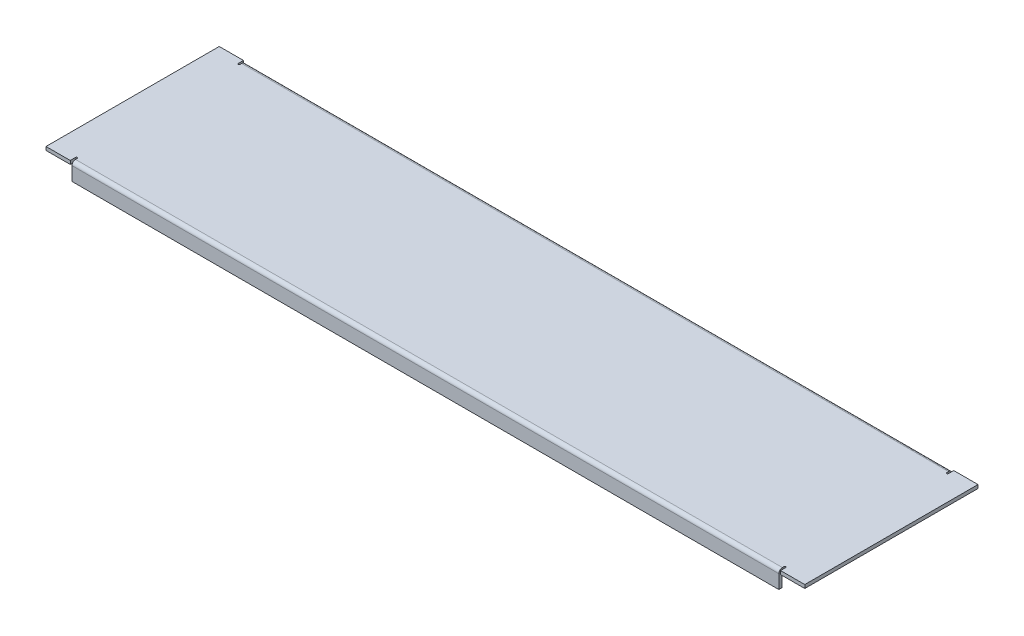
ISO-10303-21;
HEADER;
FILE_DESCRIPTION(('STEP AP214'),'2;1');
FILE_NAME('part.step','',(''),(''),'','','');
FILE_SCHEMA(('AUTOMOTIVE_DESIGN { 1 0 10303 214 1 1 1 1 }'));
ENDSEC;
DATA;
#1=APPLICATION_CONTEXT('core data for automotive mechanical design processes');
#2=APPLICATION_PROTOCOL_DEFINITION('international standard','automotive_design',2000,#1);
#3=PRODUCT_CONTEXT('',#1,'mechanical');
#4=PRODUCT('Part','Part','',(#3));
#5=PRODUCT_RELATED_PRODUCT_CATEGORY('part','',(#4));
#6=PRODUCT_DEFINITION_FORMATION('','',#4);
#7=PRODUCT_DEFINITION_CONTEXT('part definition',#1,'design');
#8=PRODUCT_DEFINITION('design','',#6,#7);
#9=PRODUCT_DEFINITION_SHAPE('','',#8);
#10=(LENGTH_UNIT() NAMED_UNIT(*) SI_UNIT(.MILLI.,.METRE.));
#11=(NAMED_UNIT(*) PLANE_ANGLE_UNIT() SI_UNIT($,.RADIAN.));
#12=(NAMED_UNIT(*) SI_UNIT($,.STERADIAN.) SOLID_ANGLE_UNIT());
#13=UNCERTAINTY_MEASURE_WITH_UNIT(LENGTH_MEASURE(1.E-05),#10,'distance_accuracy_value','');
#14=(GEOMETRIC_REPRESENTATION_CONTEXT(3) GLOBAL_UNCERTAINTY_ASSIGNED_CONTEXT((#13)) GLOBAL_UNIT_ASSIGNED_CONTEXT((#10,
#11,#12)) REPRESENTATION_CONTEXT('',''));
#15=CARTESIAN_POINT('',(0.,0.,0.));
#16=DIRECTION('',(0.,0.,1.));
#17=DIRECTION('',(1.,0.,0.));
#18=AXIS2_PLACEMENT_3D('',#15,#16,#17);
#19=CARTESIAN_POINT('',(219.,2.,-50.));
#20=DIRECTION('',(0.,-1.,0.));
#21=DIRECTION('',(0.,0.,-1.));
#22=AXIS2_PLACEMENT_3D('',#19,#20,#21);
#23=PLANE('',#22);
#24=DIRECTION('',(0.,0.,-1.));
#25=VECTOR('',#24,1.);
#26=CARTESIAN_POINT('',(205.,2.,-50.));
#27=LINE('',#26,#25);
#28=CARTESIAN_POINT('',(205.,2.,-46.95));
#29=VERTEX_POINT('',#28);
#30=CARTESIAN_POINT('',(205.,2.,-50.));
#31=VERTEX_POINT('',#30);
#32=EDGE_CURVE('E89',#29,#31,#27,.T.);
#33=ORIENTED_EDGE('',*,*,#32,.F.);
#34=CARTESIAN_POINT('',(204.5,2.,-46.95));
#35=DIRECTION('',(0.,-1.,0.));
#36=DIRECTION('',(0.,0.,-1.));
#37=AXIS2_PLACEMENT_3D('',#34,#35,#36);
#38=CIRCLE('',#37,0.5);
#39=CARTESIAN_POINT('',(204.,2.,-46.95));
#40=VERTEX_POINT('',#39);
#41=EDGE_CURVE('E93',#40,#29,#38,.F.);
#42=ORIENTED_EDGE('',*,*,#41,.F.);
#43=DIRECTION('',(0.,0.,1.));
#44=VECTOR('',#43,1.);
#45=CARTESIAN_POINT('',(204.,2.,-50.));
#46=LINE('',#45,#44);
#47=CARTESIAN_POINT('',(204.,2.00000000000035,-47.95));
#48=VERTEX_POINT('',#47);
#49=EDGE_CURVE('E373',#48,#40,#46,.T.);
#50=ORIENTED_EDGE('',*,*,#49,.F.);
#51=DIRECTION('',(1.,0.,0.));
#52=VECTOR('',#51,1.);
#53=CARTESIAN_POINT('',(204.,2.00000000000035,-47.95));
#54=LINE('',#53,#52);
#55=CARTESIAN_POINT('',(-204.,2.,-47.95));
#56=VERTEX_POINT('',#55);
#57=EDGE_CURVE('E266',#48,#56,#54,.F.);
#58=ORIENTED_EDGE('',*,*,#57,.T.);
#59=DIRECTION('',(0.,0.,-1.));
#60=VECTOR('',#59,1.);
#61=CARTESIAN_POINT('',(-204.,2.,-50.));
#62=LINE('',#61,#60);
#63=CARTESIAN_POINT('',(-204.,2.,-46.95));
#64=VERTEX_POINT('',#63);
#65=EDGE_CURVE('E370',#64,#56,#62,.T.);
#66=ORIENTED_EDGE('',*,*,#65,.F.);
#67=CARTESIAN_POINT('',(-204.5,2.,-46.95));
#68=DIRECTION('',(0.,-1.,0.));
#69=DIRECTION('',(0.,0.,-1.));
#70=AXIS2_PLACEMENT_3D('',#67,#68,#69);
#71=CIRCLE('',#70,0.5);
#72=CARTESIAN_POINT('',(-205.,2.,-46.95));
#73=VERTEX_POINT('',#72);
#74=EDGE_CURVE('E367',#73,#64,#71,.F.);
#75=ORIENTED_EDGE('',*,*,#74,.F.);
#76=DIRECTION('',(0.,0.,1.));
#77=VECTOR('',#76,1.);
#78=CARTESIAN_POINT('',(-205.,2.,-50.));
#79=LINE('',#78,#77);
#80=CARTESIAN_POINT('',(-205.,2.,-50.));
#81=VERTEX_POINT('',#80);
#82=EDGE_CURVE('E332',#81,#73,#79,.T.);
#83=ORIENTED_EDGE('',*,*,#82,.F.);
#84=DIRECTION('',(-1.,0.,0.));
#85=VECTOR('',#84,1.);
#86=CARTESIAN_POINT('',(-219.,2.,-50.));
#87=LINE('',#86,#85);
#88=CARTESIAN_POINT('',(-219.,2.,-50.));
#89=VERTEX_POINT('',#88);
#90=EDGE_CURVE('E480',#81,#89,#87,.T.);
#91=ORIENTED_EDGE('',*,*,#90,.T.);
#92=DIRECTION('',(0.,0.,1.));
#93=VECTOR('',#92,1.);
#94=CARTESIAN_POINT('',(-219.,2.,50.));
#95=LINE('',#94,#93);
#96=CARTESIAN_POINT('',(-219.,2.,50.));
#97=VERTEX_POINT('',#96);
#98=EDGE_CURVE('E484',#89,#97,#95,.T.);
#99=ORIENTED_EDGE('',*,*,#98,.T.);
#100=DIRECTION('',(1.,0.,0.));
#101=VECTOR('',#100,1.);
#102=CARTESIAN_POINT('',(-219.,2.,50.));
#103=LINE('',#102,#101);
#104=CARTESIAN_POINT('',(-205.,2.,50.));
#105=VERTEX_POINT('',#104);
#106=EDGE_CURVE('E487',#97,#105,#103,.T.);
#107=ORIENTED_EDGE('',*,*,#106,.T.);
#108=DIRECTION('',(0.,0.,1.));
#109=VECTOR('',#108,1.);
#110=CARTESIAN_POINT('',(-205.,2.,-50.));
#111=LINE('',#110,#109);
#112=CARTESIAN_POINT('',(-205.,2.,46.95));
#113=VERTEX_POINT('',#112);
#114=EDGE_CURVE('E474',#113,#105,#111,.T.);
#115=ORIENTED_EDGE('',*,*,#114,.F.);
#116=CARTESIAN_POINT('',(-204.5,2.,46.95));
#117=DIRECTION('',(0.,-1.,0.));
#118=DIRECTION('',(0.,0.,-1.));
#119=AXIS2_PLACEMENT_3D('',#116,#117,#118);
#120=CIRCLE('',#119,0.5);
#121=CARTESIAN_POINT('',(-204.,2.,46.95));
#122=VERTEX_POINT('',#121);
#123=EDGE_CURVE('E472',#122,#113,#120,.F.);
#124=ORIENTED_EDGE('',*,*,#123,.F.);
#125=DIRECTION('',(0.,0.,-1.));
#126=VECTOR('',#125,1.);
#127=CARTESIAN_POINT('',(-204.,2.,-50.));
#128=LINE('',#127,#126);
#129=CARTESIAN_POINT('',(-204.,1.99999999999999,47.95));
#130=VERTEX_POINT('',#129);
#131=EDGE_CURVE('E470',#130,#122,#128,.T.);
#132=ORIENTED_EDGE('',*,*,#131,.F.);
#133=DIRECTION('',(-1.,0.,0.));
#134=VECTOR('',#133,1.);
#135=CARTESIAN_POINT('',(-204.,1.99999999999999,47.95));
#136=LINE('',#135,#134);
#137=CARTESIAN_POINT('',(204.,2.,47.95));
#138=VERTEX_POINT('',#137);
#139=EDGE_CURVE('E409',#130,#138,#136,.F.);
#140=ORIENTED_EDGE('',*,*,#139,.T.);
#141=DIRECTION('',(0.,0.,1.));
#142=VECTOR('',#141,1.);
#143=CARTESIAN_POINT('',(204.,2.,-50.));
#144=LINE('',#143,#142);
#145=CARTESIAN_POINT('',(204.,2.,46.95));
#146=VERTEX_POINT('',#145);
#147=EDGE_CURVE('E468',#146,#138,#144,.T.);
#148=ORIENTED_EDGE('',*,*,#147,.F.);
#149=CARTESIAN_POINT('',(204.5,2.,46.95));
#150=DIRECTION('',(0.,-1.,0.));
#151=DIRECTION('',(0.,0.,-1.));
#152=AXIS2_PLACEMENT_3D('',#149,#150,#151);
#153=CIRCLE('',#152,0.5);
#154=CARTESIAN_POINT('',(205.,2.,46.95));
#155=VERTEX_POINT('',#154);
#156=EDGE_CURVE('E466',#155,#146,#153,.F.);
#157=ORIENTED_EDGE('',*,*,#156,.F.);
#158=DIRECTION('',(0.,0.,-1.));
#159=VECTOR('',#158,1.);
#160=CARTESIAN_POINT('',(205.,2.,-50.));
#161=LINE('',#160,#159);
#162=CARTESIAN_POINT('',(205.,2.,50.));
#163=VERTEX_POINT('',#162);
#164=EDGE_CURVE('E436',#163,#155,#161,.T.);
#165=ORIENTED_EDGE('',*,*,#164,.F.);
#166=CARTESIAN_POINT('',(219.,2.,50.));
#167=VERTEX_POINT('',#166);
#168=EDGE_CURVE('E486',#163,#167,#103,.T.);
#169=ORIENTED_EDGE('',*,*,#168,.T.);
#170=DIRECTION('',(0.,0.,-1.));
#171=VECTOR('',#170,1.);
#172=CARTESIAN_POINT('',(219.,2.,50.));
#173=LINE('',#172,#171);
#174=CARTESIAN_POINT('',(219.,2.,-50.));
#175=VERTEX_POINT('',#174);
#176=EDGE_CURVE('E477',#167,#175,#173,.T.);
#177=ORIENTED_EDGE('',*,*,#176,.T.);
#178=EDGE_CURVE('E482',#175,#31,#87,.T.);
#179=ORIENTED_EDGE('',*,*,#178,.T.);
#180=EDGE_LOOP('',(#33,#42,#50,#58,#66,#75,#83,#91,#99,#107,#115,#124,#132,#140,#148,#157,#165,
#169,#177,#179));
#181=FACE_BOUND('',#180,.T.);
#182=ADVANCED_FACE('F74',(#181),#23,.F.);
#183=CARTESIAN_POINT('',(219.,0.,-50.));
#184=DIRECTION('',(0.,-1.,0.));
#185=DIRECTION('',(0.,0.,-1.));
#186=AXIS2_PLACEMENT_3D('',#183,#184,#185);
#187=PLANE('',#186);
#188=CARTESIAN_POINT('',(204.5,3.53477013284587E-13,-46.95));
#189=DIRECTION('',(0.,-1.,0.));
#190=DIRECTION('',(0.,0.,-1.));
#191=AXIS2_PLACEMENT_3D('',#188,#189,#190);
#192=CIRCLE('',#191,0.5);
#193=CARTESIAN_POINT('',(205.,0.,-46.95));
#194=VERTEX_POINT('',#193);
#195=CARTESIAN_POINT('',(204.,0.,-46.95));
#196=VERTEX_POINT('',#195);
#197=EDGE_CURVE('E334',#194,#196,#192,.T.);
#198=ORIENTED_EDGE('',*,*,#197,.F.);
#199=DIRECTION('',(0.,0.,1.));
#200=VECTOR('',#199,1.);
#201=CARTESIAN_POINT('',(205.,1.76738506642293E-13,-50.));
#202=LINE('',#201,#200);
#203=CARTESIAN_POINT('',(205.,0.,-50.));
#204=VERTEX_POINT('',#203);
#205=EDGE_CURVE('E329',#204,#194,#202,.T.);
#206=ORIENTED_EDGE('',*,*,#205,.F.);
#207=DIRECTION('',(-1.,0.,0.));
#208=VECTOR('',#207,1.);
#209=CARTESIAN_POINT('',(-219.,0.,-50.));
#210=LINE('',#209,#208);
#211=CARTESIAN_POINT('',(219.,0.,-50.));
#212=VERTEX_POINT('',#211);
#213=EDGE_CURVE('E494',#212,#204,#210,.T.);
#214=ORIENTED_EDGE('',*,*,#213,.F.);
#215=DIRECTION('',(0.,0.,-1.));
#216=VECTOR('',#215,1.);
#217=CARTESIAN_POINT('',(219.,0.,50.));
#218=LINE('',#217,#216);
#219=CARTESIAN_POINT('',(219.,0.,50.));
#220=VERTEX_POINT('',#219);
#221=EDGE_CURVE('E476',#220,#212,#218,.T.);
#222=ORIENTED_EDGE('',*,*,#221,.F.);
#223=DIRECTION('',(1.,0.,0.));
#224=VECTOR('',#223,1.);
#225=CARTESIAN_POINT('',(-219.,0.,50.));
#226=LINE('',#225,#224);
#227=CARTESIAN_POINT('',(205.,0.,50.));
#228=VERTEX_POINT('',#227);
#229=EDGE_CURVE('E499',#228,#220,#226,.T.);
#230=ORIENTED_EDGE('',*,*,#229,.F.);
#231=DIRECTION('',(0.,0.,1.));
#232=VECTOR('',#231,1.);
#233=CARTESIAN_POINT('',(205.,0.,46.95));
#234=LINE('',#233,#232);
#235=CARTESIAN_POINT('',(205.,0.,46.95));
#236=VERTEX_POINT('',#235);
#237=EDGE_CURVE('E451',#236,#228,#234,.T.);
#238=ORIENTED_EDGE('',*,*,#237,.F.);
#239=CARTESIAN_POINT('',(204.5,0.,46.95));
#240=DIRECTION('',(0.,-1.,0.));
#241=DIRECTION('',(0.,0.,-1.));
#242=AXIS2_PLACEMENT_3D('',#239,#240,#241);
#243=CIRCLE('',#242,0.5);
#244=CARTESIAN_POINT('',(204.,0.,46.95));
#245=VERTEX_POINT('',#244);
#246=EDGE_CURVE('E448',#245,#236,#243,.T.);
#247=ORIENTED_EDGE('',*,*,#246,.F.);
#248=DIRECTION('',(0.,0.,-1.));
#249=VECTOR('',#248,1.);
#250=CARTESIAN_POINT('',(204.,0.,47.95));
#251=LINE('',#250,#249);
#252=CARTESIAN_POINT('',(204.,0.,47.95));
#253=VERTEX_POINT('',#252);
#254=EDGE_CURVE('E445',#253,#245,#251,.T.);
#255=ORIENTED_EDGE('',*,*,#254,.F.);
#256=DIRECTION('',(-1.,0.,0.));
#257=VECTOR('',#256,1.);
#258=CARTESIAN_POINT('',(-204.,0.,47.95));
#259=LINE('',#258,#257);
#260=CARTESIAN_POINT('',(-204.,0.,47.95));
#261=VERTEX_POINT('',#260);
#262=EDGE_CURVE('E422',#261,#253,#259,.F.);
#263=ORIENTED_EDGE('',*,*,#262,.F.);
#264=DIRECTION('',(0.,0.,1.));
#265=VECTOR('',#264,1.);
#266=CARTESIAN_POINT('',(-204.,0.,46.95));
#267=LINE('',#266,#265);
#268=CARTESIAN_POINT('',(-204.,0.,46.95));
#269=VERTEX_POINT('',#268);
#270=EDGE_CURVE('E442',#269,#261,#267,.T.);
#271=ORIENTED_EDGE('',*,*,#270,.F.);
#272=CARTESIAN_POINT('',(-204.5,0.,46.95));
#273=DIRECTION('',(0.,-1.,0.));
#274=DIRECTION('',(0.,0.,-1.));
#275=AXIS2_PLACEMENT_3D('',#272,#273,#274);
#276=CIRCLE('',#275,0.5);
#277=CARTESIAN_POINT('',(-205.,0.,46.95));
#278=VERTEX_POINT('',#277);
#279=EDGE_CURVE('E438',#278,#269,#276,.T.);
#280=ORIENTED_EDGE('',*,*,#279,.F.);
#281=DIRECTION('',(0.,0.,-1.));
#282=VECTOR('',#281,1.);
#283=CARTESIAN_POINT('',(-205.,0.,50.));
#284=LINE('',#283,#282);
#285=CARTESIAN_POINT('',(-205.,0.,50.));
#286=VERTEX_POINT('',#285);
#287=EDGE_CURVE('E433',#286,#278,#284,.T.);
#288=ORIENTED_EDGE('',*,*,#287,.F.);
#289=CARTESIAN_POINT('',(-219.,0.,50.));
#290=VERTEX_POINT('',#289);
#291=EDGE_CURVE('E481',#290,#286,#226,.T.);
#292=ORIENTED_EDGE('',*,*,#291,.F.);
#293=DIRECTION('',(0.,0.,1.));
#294=VECTOR('',#293,1.);
#295=CARTESIAN_POINT('',(-219.,0.,50.));
#296=LINE('',#295,#294);
#297=CARTESIAN_POINT('',(-219.,0.,-50.));
#298=VERTEX_POINT('',#297);
#299=EDGE_CURVE('E497',#298,#290,#296,.T.);
#300=ORIENTED_EDGE('',*,*,#299,.F.);
#301=CARTESIAN_POINT('',(-205.,0.,-50.));
#302=VERTEX_POINT('',#301);
#303=EDGE_CURVE('E493',#302,#298,#210,.T.);
#304=ORIENTED_EDGE('',*,*,#303,.F.);
#305=DIRECTION('',(0.,0.,-1.));
#306=VECTOR('',#305,1.);
#307=CARTESIAN_POINT('',(-205.,3.25829857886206E-13,-46.95));
#308=LINE('',#307,#306);
#309=CARTESIAN_POINT('',(-205.,0.,-46.95));
#310=VERTEX_POINT('',#309);
#311=EDGE_CURVE('E349',#310,#302,#308,.T.);
#312=ORIENTED_EDGE('',*,*,#311,.F.);
#313=CARTESIAN_POINT('',(-204.5,3.25829857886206E-13,-46.95));
#314=DIRECTION('',(0.,-1.,0.));
#315=DIRECTION('',(0.,0.,-1.));
#316=AXIS2_PLACEMENT_3D('',#313,#314,#315);
#317=CIRCLE('',#316,0.5);
#318=CARTESIAN_POINT('',(-204.,0.,-46.95));
#319=VERTEX_POINT('',#318);
#320=EDGE_CURVE('E345',#319,#310,#317,.T.);
#321=ORIENTED_EDGE('',*,*,#320,.F.);
#322=DIRECTION('',(0.,0.,1.));
#323=VECTOR('',#322,1.);
#324=CARTESIAN_POINT('',(-204.,3.25829857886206E-13,-47.95));
#325=LINE('',#324,#323);
#326=CARTESIAN_POINT('',(-204.,0.,-47.95));
#327=VERTEX_POINT('',#326);
#328=EDGE_CURVE('E342',#327,#319,#325,.T.);
#329=ORIENTED_EDGE('',*,*,#328,.F.);
#330=DIRECTION('',(1.,0.,0.));
#331=VECTOR('',#330,1.);
#332=CARTESIAN_POINT('',(204.,3.53477013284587E-13,-47.95));
#333=LINE('',#332,#331);
#334=CARTESIAN_POINT('',(204.,0.,-47.95));
#335=VERTEX_POINT('',#334);
#336=EDGE_CURVE('E320',#335,#327,#333,.F.);
#337=ORIENTED_EDGE('',*,*,#336,.F.);
#338=DIRECTION('',(0.,0.,-1.));
#339=VECTOR('',#338,1.);
#340=CARTESIAN_POINT('',(204.,3.53477013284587E-13,-46.95));
#341=LINE('',#340,#339);
#342=EDGE_CURVE('E338',#196,#335,#341,.T.);
#343=ORIENTED_EDGE('',*,*,#342,.F.);
#344=EDGE_LOOP('',(#198,#206,#214,#222,#230,#238,#247,#255,#263,#271,#280,#288,#292,#300,#304,
#312,#321,#329,#337,#343));
#345=FACE_BOUND('',#344,.T.);
#346=ADVANCED_FACE('F517',(#345),#187,.T.);
#347=CARTESIAN_POINT('',(-219.,2.,-50.));
#348=DIRECTION('',(0.,0.,1.));
#349=DIRECTION('',(1.,0.,0.));
#350=AXIS2_PLACEMENT_3D('',#347,#348,#349);
#351=PLANE('',#350);
#352=DIRECTION('',(0.,1.,0.));
#353=VECTOR('',#352,1.);
#354=CARTESIAN_POINT('',(205.,1.76738506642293E-13,-50.));
#355=LINE('',#354,#353);
#356=EDGE_CURVE('E333',#204,#31,#355,.T.);
#357=ORIENTED_EDGE('',*,*,#356,.T.);
#358=ORIENTED_EDGE('',*,*,#178,.F.);
#359=DIRECTION('',(0.,-1.,0.));
#360=VECTOR('',#359,1.);
#361=CARTESIAN_POINT('',(219.,2.,-50.));
#362=LINE('',#361,#360);
#363=EDGE_CURVE('E13',#175,#212,#362,.T.);
#364=ORIENTED_EDGE('',*,*,#363,.T.);
#365=ORIENTED_EDGE('',*,*,#213,.T.);
#366=EDGE_LOOP('',(#357,#358,#364,#365));
#367=FACE_BOUND('',#366,.T.);
#368=ADVANCED_FACE('F564',(#367),#351,.F.);
#369=DIRECTION('',(0.,1.,0.));
#370=VECTOR('',#369,1.);
#371=CARTESIAN_POINT('',(-205.,1.62914928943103E-13,-50.));
#372=LINE('',#371,#370);
#373=EDGE_CURVE('E352',#302,#81,#372,.T.);
#374=ORIENTED_EDGE('',*,*,#373,.F.);
#375=ORIENTED_EDGE('',*,*,#303,.T.);
#376=DIRECTION('',(0.,-1.,0.));
#377=VECTOR('',#376,1.);
#378=CARTESIAN_POINT('',(-219.,2.,-50.));
#379=LINE('',#378,#377);
#380=EDGE_CURVE('E82',#89,#298,#379,.T.);
#381=ORIENTED_EDGE('',*,*,#380,.F.);
#382=ORIENTED_EDGE('',*,*,#90,.F.);
#383=EDGE_LOOP('',(#374,#375,#381,#382));
#384=FACE_BOUND('',#383,.T.);
#385=ADVANCED_FACE('F526',(#384),#351,.F.);
#386=CARTESIAN_POINT('',(-219.,2.,50.));
#387=DIRECTION('',(0.,0.,-1.));
#388=DIRECTION('',(-1.,0.,0.));
#389=AXIS2_PLACEMENT_3D('',#386,#387,#388);
#390=PLANE('',#389);
#391=DIRECTION('',(0.,1.,0.));
#392=VECTOR('',#391,1.);
#393=CARTESIAN_POINT('',(-205.,0.,50.));
#394=LINE('',#393,#392);
#395=EDGE_CURVE('E437',#286,#105,#394,.T.);
#396=ORIENTED_EDGE('',*,*,#395,.T.);
#397=ORIENTED_EDGE('',*,*,#106,.F.);
#398=DIRECTION('',(0.,-1.,0.));
#399=VECTOR('',#398,1.);
#400=CARTESIAN_POINT('',(-219.,2.,50.));
#401=LINE('',#400,#399);
#402=EDGE_CURVE('E504',#97,#290,#401,.T.);
#403=ORIENTED_EDGE('',*,*,#402,.T.);
#404=ORIENTED_EDGE('',*,*,#291,.T.);
#405=EDGE_LOOP('',(#396,#397,#403,#404));
#406=FACE_BOUND('',#405,.T.);
#407=ADVANCED_FACE('F521',(#406),#390,.F.);
#408=DIRECTION('',(0.,1.,0.));
#409=VECTOR('',#408,1.);
#410=CARTESIAN_POINT('',(205.,0.,50.));
#411=LINE('',#410,#409);
#412=EDGE_CURVE('E453',#228,#163,#411,.T.);
#413=ORIENTED_EDGE('',*,*,#412,.F.);
#414=ORIENTED_EDGE('',*,*,#229,.T.);
#415=DIRECTION('',(0.,-1.,0.));
#416=VECTOR('',#415,1.);
#417=CARTESIAN_POINT('',(219.,2.,50.));
#418=LINE('',#417,#416);
#419=EDGE_CURVE('E490',#167,#220,#418,.T.);
#420=ORIENTED_EDGE('',*,*,#419,.F.);
#421=ORIENTED_EDGE('',*,*,#168,.F.);
#422=EDGE_LOOP('',(#413,#414,#420,#421));
#423=FACE_BOUND('',#422,.T.);
#424=ADVANCED_FACE('F572',(#423),#390,.F.);
#425=CARTESIAN_POINT('',(219.,2.,50.));
#426=DIRECTION('',(-1.,0.,0.));
#427=DIRECTION('',(0.,0.,1.));
#428=AXIS2_PLACEMENT_3D('',#425,#426,#427);
#429=PLANE('',#428);
#430=ORIENTED_EDGE('',*,*,#221,.T.);
#431=ORIENTED_EDGE('',*,*,#363,.F.);
#432=ORIENTED_EDGE('',*,*,#176,.F.);
#433=ORIENTED_EDGE('',*,*,#419,.T.);
#434=EDGE_LOOP('',(#430,#431,#432,#433));
#435=FACE_BOUND('',#434,.T.);
#436=ADVANCED_FACE('F76',(#435),#429,.F.);
#437=CARTESIAN_POINT('',(-219.,2.,50.));
#438=DIRECTION('',(1.,0.,0.));
#439=DIRECTION('',(0.,0.,-1.));
#440=AXIS2_PLACEMENT_3D('',#437,#438,#439);
#441=PLANE('',#440);
#442=ORIENTED_EDGE('',*,*,#299,.T.);
#443=ORIENTED_EDGE('',*,*,#402,.F.);
#444=ORIENTED_EDGE('',*,*,#98,.F.);
#445=ORIENTED_EDGE('',*,*,#380,.T.);
#446=EDGE_LOOP('',(#442,#443,#444,#445));
#447=FACE_BOUND('',#446,.T.);
#448=ADVANCED_FACE('F511',(#447),#441,.F.);
#449=CARTESIAN_POINT('',(-205.,0.,50.));
#450=DIRECTION('',(1.,0.,0.));
#451=DIRECTION('',(0.,0.,-1.));
#452=AXIS2_PLACEMENT_3D('',#449,#450,#451);
#453=PLANE('',#452);
#454=DIRECTION('',(0.,1.,0.));
#455=VECTOR('',#454,1.);
#456=CARTESIAN_POINT('',(-205.,0.,46.95));
#457=LINE('',#456,#455);
#458=EDGE_CURVE('E441',#278,#113,#457,.T.);
#459=ORIENTED_EDGE('',*,*,#458,.T.);
#460=ORIENTED_EDGE('',*,*,#114,.T.);
#461=ORIENTED_EDGE('',*,*,#395,.F.);
#462=ORIENTED_EDGE('',*,*,#287,.T.);
#463=EDGE_LOOP('',(#459,#460,#461,#462));
#464=FACE_BOUND('',#463,.T.);
#465=ADVANCED_FACE('F567',(#464),#453,.T.);
#466=CARTESIAN_POINT('',(-204.5,0.,46.95));
#467=DIRECTION('',(0.,1.,0.));
#468=DIRECTION('',(0.,0.,1.));
#469=AXIS2_PLACEMENT_3D('',#466,#467,#468);
#470=CYLINDRICAL_SURFACE('',#469,0.5);
#471=DIRECTION('',(0.,1.,0.));
#472=VECTOR('',#471,1.);
#473=CARTESIAN_POINT('',(-204.,0.,46.95));
#474=LINE('',#473,#472);
#475=EDGE_CURVE('E444',#269,#122,#474,.T.);
#476=ORIENTED_EDGE('',*,*,#475,.T.);
#477=ORIENTED_EDGE('',*,*,#123,.T.);
#478=ORIENTED_EDGE('',*,*,#458,.F.);
#479=ORIENTED_EDGE('',*,*,#279,.T.);
#480=EDGE_LOOP('',(#476,#477,#478,#479));
#481=FACE_BOUND('',#480,.T.);
#482=ADVANCED_FACE('F665',(#481),#470,.F.);
#483=CARTESIAN_POINT('',(-204.,0.,46.95));
#484=DIRECTION('',(-1.,0.,0.));
#485=DIRECTION('',(0.,0.,1.));
#486=AXIS2_PLACEMENT_3D('',#483,#484,#485);
#487=PLANE('',#486);
#488=DIRECTION('',(0.,1.,0.));
#489=VECTOR('',#488,1.);
#490=CARTESIAN_POINT('',(-204.,0.,47.95));
#491=LINE('',#490,#489);
#492=EDGE_CURVE('E416',#261,#130,#491,.T.);
#493=ORIENTED_EDGE('',*,*,#492,.T.);
#494=ORIENTED_EDGE('',*,*,#131,.T.);
#495=ORIENTED_EDGE('',*,*,#475,.F.);
#496=ORIENTED_EDGE('',*,*,#270,.T.);
#497=EDGE_LOOP('',(#493,#494,#495,#496));
#498=FACE_BOUND('',#497,.T.);
#499=ADVANCED_FACE('F641',(#498),#487,.T.);
#500=CARTESIAN_POINT('',(204.,0.,47.95));
#501=DIRECTION('',(1.,0.,0.));
#502=DIRECTION('',(0.,0.,-1.));
#503=AXIS2_PLACEMENT_3D('',#500,#501,#502);
#504=PLANE('',#503);
#505=DIRECTION('',(0.,1.,0.));
#506=VECTOR('',#505,1.);
#507=CARTESIAN_POINT('',(204.,0.,46.95));
#508=LINE('',#507,#506);
#509=EDGE_CURVE('E450',#245,#146,#508,.T.);
#510=ORIENTED_EDGE('',*,*,#509,.T.);
#511=ORIENTED_EDGE('',*,*,#147,.T.);
#512=DIRECTION('',(0.,1.,0.));
#513=VECTOR('',#512,1.);
#514=CARTESIAN_POINT('',(204.,0.,47.95));
#515=LINE('',#514,#513);
#516=EDGE_CURVE('E427',#253,#138,#515,.T.);
#517=ORIENTED_EDGE('',*,*,#516,.F.);
#518=ORIENTED_EDGE('',*,*,#254,.T.);
#519=EDGE_LOOP('',(#510,#511,#517,#518));
#520=FACE_BOUND('',#519,.T.);
#521=ADVANCED_FACE('F610',(#520),#504,.T.);
#522=CARTESIAN_POINT('',(204.5,0.,46.95));
#523=DIRECTION('',(0.,1.,0.));
#524=DIRECTION('',(0.,0.,1.));
#525=AXIS2_PLACEMENT_3D('',#522,#523,#524);
#526=CYLINDRICAL_SURFACE('',#525,0.5);
#527=DIRECTION('',(0.,1.,0.));
#528=VECTOR('',#527,1.);
#529=CARTESIAN_POINT('',(205.,0.,46.95));
#530=LINE('',#529,#528);
#531=EDGE_CURVE('E430',#236,#155,#530,.T.);
#532=ORIENTED_EDGE('',*,*,#531,.T.);
#533=ORIENTED_EDGE('',*,*,#156,.T.);
#534=ORIENTED_EDGE('',*,*,#509,.F.);
#535=ORIENTED_EDGE('',*,*,#246,.T.);
#536=EDGE_LOOP('',(#532,#533,#534,#535));
#537=FACE_BOUND('',#536,.T.);
#538=ADVANCED_FACE('F606',(#537),#526,.F.);
#539=CARTESIAN_POINT('',(205.,0.,46.95));
#540=DIRECTION('',(-1.,0.,0.));
#541=DIRECTION('',(0.,0.,1.));
#542=AXIS2_PLACEMENT_3D('',#539,#540,#541);
#543=PLANE('',#542);
#544=ORIENTED_EDGE('',*,*,#412,.T.);
#545=ORIENTED_EDGE('',*,*,#164,.T.);
#546=ORIENTED_EDGE('',*,*,#531,.F.);
#547=ORIENTED_EDGE('',*,*,#237,.T.);
#548=EDGE_LOOP('',(#544,#545,#546,#547));
#549=FACE_BOUND('',#548,.T.);
#550=ADVANCED_FACE('F602',(#549),#543,.T.);
#551=CARTESIAN_POINT('',(204.,-0.0500000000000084,47.95));
#552=DIRECTION('',(1.,0.,0.));
#553=DIRECTION('',(0.,0.,-1.));
#554=AXIS2_PLACEMENT_3D('',#551,#552,#553);
#555=PLANE('',#554);
#556=DIRECTION('',(0.,0.,1.));
#557=VECTOR('',#556,1.);
#558=CARTESIAN_POINT('',(204.,-0.0500000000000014,50.));
#559=LINE('',#558,#557);
#560=CARTESIAN_POINT('',(204.,-0.0500000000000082,48.));
#561=VERTEX_POINT('',#560);
#562=CARTESIAN_POINT('',(204.,-0.0500000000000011,50.));
#563=VERTEX_POINT('',#562);
#564=EDGE_CURVE('E376',#561,#563,#559,.T.);
#565=ORIENTED_EDGE('',*,*,#564,.F.);
#566=CARTESIAN_POINT('',(204.,-0.0500000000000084,47.95));
#567=DIRECTION('',(-1.,0.,0.));
#568=DIRECTION('',(0.,0.,1.));
#569=AXIS2_PLACEMENT_3D('',#566,#567,#568);
#570=CIRCLE('',#569,0.0500000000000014);
#571=EDGE_CURVE('E419',#253,#561,#570,.F.);
#572=ORIENTED_EDGE('',*,*,#571,.F.);
#573=ORIENTED_EDGE('',*,*,#516,.T.);
#574=CARTESIAN_POINT('',(204.,-0.0500000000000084,47.95));
#575=DIRECTION('',(-1.,0.,0.));
#576=DIRECTION('',(0.,0.,1.));
#577=AXIS2_PLACEMENT_3D('',#574,#575,#576);
#578=CIRCLE('',#577,2.05);
#579=EDGE_CURVE('E412',#138,#563,#578,.F.);
#580=ORIENTED_EDGE('',*,*,#579,.T.);
#581=EDGE_LOOP('',(#565,#572,#573,#580));
#582=FACE_BOUND('',#581,.T.);
#583=ADVANCED_FACE('F620',(#582),#555,.T.);
#584=CARTESIAN_POINT('',(-204.,-0.0500000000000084,47.95));
#585=DIRECTION('',(1.,0.,0.));
#586=DIRECTION('',(0.,0.,-1.));
#587=AXIS2_PLACEMENT_3D('',#584,#585,#586);
#588=PLANE('',#587);
#589=CARTESIAN_POINT('',(-204.,-0.0500000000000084,47.95));
#590=DIRECTION('',(-1.,0.,0.));
#591=DIRECTION('',(0.,0.,1.));
#592=AXIS2_PLACEMENT_3D('',#589,#590,#591);
#593=CIRCLE('',#592,0.0500000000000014);
#594=CARTESIAN_POINT('',(-204.,-0.0500000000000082,48.));
#595=VERTEX_POINT('',#594);
#596=EDGE_CURVE('E380',#595,#261,#593,.T.);
#597=ORIENTED_EDGE('',*,*,#596,.F.);
#598=DIRECTION('',(0.,0.,1.));
#599=VECTOR('',#598,1.);
#600=CARTESIAN_POINT('',(-204.,-0.0500000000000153,48.));
#601=LINE('',#600,#599);
#602=CARTESIAN_POINT('',(-204.,-0.0500000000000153,50.));
#603=VERTEX_POINT('',#602);
#604=EDGE_CURVE('E402',#595,#603,#601,.T.);
#605=ORIENTED_EDGE('',*,*,#604,.T.);
#606=CARTESIAN_POINT('',(-204.,-0.0500000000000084,47.95));
#607=DIRECTION('',(-1.,0.,0.));
#608=DIRECTION('',(0.,0.,1.));
#609=AXIS2_PLACEMENT_3D('',#606,#607,#608);
#610=CIRCLE('',#609,2.05);
#611=EDGE_CURVE('E413',#603,#130,#610,.T.);
#612=ORIENTED_EDGE('',*,*,#611,.T.);
#613=ORIENTED_EDGE('',*,*,#492,.F.);
#614=EDGE_LOOP('',(#597,#605,#612,#613));
#615=FACE_BOUND('',#614,.T.);
#616=ADVANCED_FACE('F639',(#615),#588,.F.);
#617=CARTESIAN_POINT('',(-204.,-0.0500000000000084,47.95));
#618=DIRECTION('',(-1.,0.,0.));
#619=DIRECTION('',(0.,0.,1.));
#620=AXIS2_PLACEMENT_3D('',#617,#618,#619);
#621=CYLINDRICAL_SURFACE('',#620,2.05);
#622=ORIENTED_EDGE('',*,*,#139,.F.);
#623=ORIENTED_EDGE('',*,*,#611,.F.);
#624=DIRECTION('',(-1.,0.,0.));
#625=VECTOR('',#624,1.);
#626=CARTESIAN_POINT('',(204.,-0.0500000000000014,50.));
#627=LINE('',#626,#625);
#628=EDGE_CURVE('E399',#563,#603,#627,.T.);
#629=ORIENTED_EDGE('',*,*,#628,.F.);
#630=ORIENTED_EDGE('',*,*,#579,.F.);
#631=EDGE_LOOP('',(#622,#623,#629,#630));
#632=FACE_BOUND('',#631,.T.);
#633=ADVANCED_FACE('F643',(#632),#621,.T.);
#634=CARTESIAN_POINT('',(-204.,-0.0500000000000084,47.95));
#635=DIRECTION('',(-1.,0.,0.));
#636=DIRECTION('',(0.,0.,1.));
#637=AXIS2_PLACEMENT_3D('',#634,#635,#636);
#638=CYLINDRICAL_SURFACE('',#637,0.0500000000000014);
#639=ORIENTED_EDGE('',*,*,#262,.T.);
#640=ORIENTED_EDGE('',*,*,#571,.T.);
#641=DIRECTION('',(1.,0.,0.));
#642=VECTOR('',#641,1.);
#643=CARTESIAN_POINT('',(204.,-0.0500000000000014,48.));
#644=LINE('',#643,#642);
#645=EDGE_CURVE('E405',#561,#595,#644,.F.);
#646=ORIENTED_EDGE('',*,*,#645,.T.);
#647=ORIENTED_EDGE('',*,*,#596,.T.);
#648=EDGE_LOOP('',(#639,#640,#646,#647));
#649=FACE_BOUND('',#648,.T.);
#650=ADVANCED_FACE('F616',(#649),#638,.F.);
#651=CARTESIAN_POINT('',(204.,-8.,50.));
#652=DIRECTION('',(1.,0.,0.));
#653=DIRECTION('',(0.,0.,-1.));
#654=AXIS2_PLACEMENT_3D('',#651,#652,#653);
#655=PLANE('',#654);
#656=DIRECTION('',(0.,1.,0.));
#657=VECTOR('',#656,1.);
#658=CARTESIAN_POINT('',(204.,-8.00000000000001,48.));
#659=LINE('',#658,#657);
#660=CARTESIAN_POINT('',(204.,-8.00000000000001,48.));
#661=VERTEX_POINT('',#660);
#662=EDGE_CURVE('E391',#561,#661,#659,.F.);
#663=ORIENTED_EDGE('',*,*,#662,.F.);
#664=ORIENTED_EDGE('',*,*,#564,.T.);
#665=DIRECTION('',(0.,-1.,0.));
#666=VECTOR('',#665,1.);
#667=CARTESIAN_POINT('',(204.,-8.,50.));
#668=LINE('',#667,#666);
#669=CARTESIAN_POINT('',(204.,-8.,50.));
#670=VERTEX_POINT('',#669);
#671=EDGE_CURVE('E383',#563,#670,#668,.T.);
#672=ORIENTED_EDGE('',*,*,#671,.T.);
#673=DIRECTION('',(0.,0.,-1.));
#674=VECTOR('',#673,1.);
#675=CARTESIAN_POINT('',(204.,-8.,50.));
#676=LINE('',#675,#674);
#677=EDGE_CURVE('E377',#670,#661,#676,.T.);
#678=ORIENTED_EDGE('',*,*,#677,.T.);
#679=EDGE_LOOP('',(#663,#664,#672,#678));
#680=FACE_BOUND('',#679,.T.);
#681=ADVANCED_FACE('F625',(#680),#655,.T.);
#682=CARTESIAN_POINT('',(-204.,-8.,50.));
#683=DIRECTION('',(-1.,0.,0.));
#684=DIRECTION('',(0.,0.,1.));
#685=AXIS2_PLACEMENT_3D('',#682,#683,#684);
#686=PLANE('',#685);
#687=DIRECTION('',(0.,1.,0.));
#688=VECTOR('',#687,1.);
#689=CARTESIAN_POINT('',(-204.,-8.,50.));
#690=LINE('',#689,#688);
#691=CARTESIAN_POINT('',(-204.,-8.,50.));
#692=VERTEX_POINT('',#691);
#693=EDGE_CURVE('E385',#692,#603,#690,.T.);
#694=ORIENTED_EDGE('',*,*,#693,.T.);
#695=ORIENTED_EDGE('',*,*,#604,.F.);
#696=DIRECTION('',(0.,-1.,0.));
#697=VECTOR('',#696,1.);
#698=CARTESIAN_POINT('',(-204.,-8.00000000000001,48.));
#699=LINE('',#698,#697);
#700=CARTESIAN_POINT('',(-204.,-8.00000000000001,48.));
#701=VERTEX_POINT('',#700);
#702=EDGE_CURVE('E393',#701,#595,#699,.F.);
#703=ORIENTED_EDGE('',*,*,#702,.F.);
#704=DIRECTION('',(0.,0.,-1.));
#705=VECTOR('',#704,1.);
#706=CARTESIAN_POINT('',(-204.,-8.,50.));
#707=LINE('',#706,#705);
#708=EDGE_CURVE('E381',#692,#701,#707,.T.);
#709=ORIENTED_EDGE('',*,*,#708,.F.);
#710=EDGE_LOOP('',(#694,#695,#703,#709));
#711=FACE_BOUND('',#710,.T.);
#712=ADVANCED_FACE('F885',(#711),#686,.T.);
#713=CARTESIAN_POINT('',(204.,-8.,50.));
#714=DIRECTION('',(0.,0.,1.));
#715=DIRECTION('',(0.,-1.,0.));
#716=AXIS2_PLACEMENT_3D('',#713,#714,#715);
#717=PLANE('',#716);
#718=ORIENTED_EDGE('',*,*,#671,.F.);
#719=ORIENTED_EDGE('',*,*,#628,.T.);
#720=ORIENTED_EDGE('',*,*,#693,.F.);
#721=DIRECTION('',(-1.,0.,0.));
#722=VECTOR('',#721,1.);
#723=CARTESIAN_POINT('',(-204.,-8.,50.));
#724=LINE('',#723,#722);
#725=EDGE_CURVE('E388',#670,#692,#724,.T.);
#726=ORIENTED_EDGE('',*,*,#725,.F.);
#727=EDGE_LOOP('',(#718,#719,#720,#726));
#728=FACE_BOUND('',#727,.T.);
#729=ADVANCED_FACE('F629',(#728),#717,.T.);
#730=CARTESIAN_POINT('',(204.,-8.00000000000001,48.));
#731=DIRECTION('',(0.,0.,1.));
#732=DIRECTION('',(0.,-1.,0.));
#733=AXIS2_PLACEMENT_3D('',#730,#731,#732);
#734=PLANE('',#733);
#735=ORIENTED_EDGE('',*,*,#645,.F.);
#736=ORIENTED_EDGE('',*,*,#662,.T.);
#737=DIRECTION('',(1.,0.,0.));
#738=VECTOR('',#737,1.);
#739=CARTESIAN_POINT('',(204.,-8.00000000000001,48.));
#740=LINE('',#739,#738);
#741=EDGE_CURVE('E396',#661,#701,#740,.F.);
#742=ORIENTED_EDGE('',*,*,#741,.T.);
#743=ORIENTED_EDGE('',*,*,#702,.T.);
#744=EDGE_LOOP('',(#735,#736,#742,#743));
#745=FACE_BOUND('',#744,.T.);
#746=ADVANCED_FACE('F636',(#745),#734,.F.);
#747=CARTESIAN_POINT('',(-204.,-8.,50.));
#748=DIRECTION('',(0.,-1.,0.));
#749=DIRECTION('',(0.,0.,-1.));
#750=AXIS2_PLACEMENT_3D('',#747,#748,#749);
#751=PLANE('',#750);
#752=ORIENTED_EDGE('',*,*,#741,.F.);
#753=ORIENTED_EDGE('',*,*,#677,.F.);
#754=ORIENTED_EDGE('',*,*,#725,.T.);
#755=ORIENTED_EDGE('',*,*,#708,.T.);
#756=EDGE_LOOP('',(#752,#753,#754,#755));
#757=FACE_BOUND('',#756,.T.);
#758=ADVANCED_FACE('F633',(#757),#751,.T.);
#759=CARTESIAN_POINT('',(204.5,3.53477013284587E-13,-46.95));
#760=DIRECTION('',(0.,1.,0.));
#761=DIRECTION('',(0.,0.,1.));
#762=AXIS2_PLACEMENT_3D('',#759,#760,#761);
#763=CYLINDRICAL_SURFACE('',#762,0.5);
#764=DIRECTION('',(0.,1.,0.));
#765=VECTOR('',#764,1.);
#766=CARTESIAN_POINT('',(204.,3.53477013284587E-13,-46.95));
#767=LINE('',#766,#765);
#768=EDGE_CURVE('E341',#196,#40,#767,.T.);
#769=ORIENTED_EDGE('',*,*,#768,.T.);
#770=ORIENTED_EDGE('',*,*,#41,.T.);
#771=DIRECTION('',(0.,1.,0.));
#772=VECTOR('',#771,1.);
#773=CARTESIAN_POINT('',(205.,3.53477013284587E-13,-46.95));
#774=LINE('',#773,#772);
#775=EDGE_CURVE('E337',#194,#29,#774,.T.);
#776=ORIENTED_EDGE('',*,*,#775,.F.);
#777=ORIENTED_EDGE('',*,*,#197,.T.);
#778=EDGE_LOOP('',(#769,#770,#776,#777));
#779=FACE_BOUND('',#778,.T.);
#780=ADVANCED_FACE('F586',(#779),#763,.F.);
#781=CARTESIAN_POINT('',(204.,3.53477013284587E-13,-46.95));
#782=DIRECTION('',(1.,0.,0.));
#783=DIRECTION('',(0.,0.,-1.));
#784=AXIS2_PLACEMENT_3D('',#781,#782,#783);
#785=PLANE('',#784);
#786=DIRECTION('',(0.,1.,0.));
#787=VECTOR('',#786,1.);
#788=CARTESIAN_POINT('',(204.,3.53477013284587E-13,-47.95));
#789=LINE('',#788,#787);
#790=EDGE_CURVE('E316',#335,#48,#789,.T.);
#791=ORIENTED_EDGE('',*,*,#790,.T.);
#792=ORIENTED_EDGE('',*,*,#49,.T.);
#793=ORIENTED_EDGE('',*,*,#768,.F.);
#794=ORIENTED_EDGE('',*,*,#342,.T.);
#795=EDGE_LOOP('',(#791,#792,#793,#794));
#796=FACE_BOUND('',#795,.T.);
#797=ADVANCED_FACE('F589',(#796),#785,.T.);
#798=CARTESIAN_POINT('',(-204.,3.25829857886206E-13,-47.95));
#799=DIRECTION('',(-1.,0.,0.));
#800=DIRECTION('',(0.,0.,1.));
#801=AXIS2_PLACEMENT_3D('',#798,#799,#800);
#802=PLANE('',#801);
#803=DIRECTION('',(0.,1.,0.));
#804=VECTOR('',#803,1.);
#805=CARTESIAN_POINT('',(-204.,3.25829857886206E-13,-46.95));
#806=LINE('',#805,#804);
#807=EDGE_CURVE('E348',#319,#64,#806,.T.);
#808=ORIENTED_EDGE('',*,*,#807,.T.);
#809=ORIENTED_EDGE('',*,*,#65,.T.);
#810=DIRECTION('',(0.,1.,0.));
#811=VECTOR('',#810,1.);
#812=CARTESIAN_POINT('',(-204.,3.25829857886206E-13,-47.95));
#813=LINE('',#812,#811);
#814=EDGE_CURVE('E324',#327,#56,#813,.T.);
#815=ORIENTED_EDGE('',*,*,#814,.F.);
#816=ORIENTED_EDGE('',*,*,#328,.T.);
#817=EDGE_LOOP('',(#808,#809,#815,#816));
#818=FACE_BOUND('',#817,.T.);
#819=ADVANCED_FACE('F535',(#818),#802,.T.);
#820=CARTESIAN_POINT('',(-204.5,3.25829857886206E-13,-46.95));
#821=DIRECTION('',(0.,1.,0.));
#822=DIRECTION('',(0.,0.,1.));
#823=AXIS2_PLACEMENT_3D('',#820,#821,#822);
#824=CYLINDRICAL_SURFACE('',#823,0.5);
#825=DIRECTION('',(0.,1.,0.));
#826=VECTOR('',#825,1.);
#827=CARTESIAN_POINT('',(-205.,3.25829857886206E-13,-46.95));
#828=LINE('',#827,#826);
#829=EDGE_CURVE('E327',#310,#73,#828,.T.);
#830=ORIENTED_EDGE('',*,*,#829,.T.);
#831=ORIENTED_EDGE('',*,*,#74,.T.);
#832=ORIENTED_EDGE('',*,*,#807,.F.);
#833=ORIENTED_EDGE('',*,*,#320,.T.);
#834=EDGE_LOOP('',(#830,#831,#832,#833));
#835=FACE_BOUND('',#834,.T.);
#836=ADVANCED_FACE('F533',(#835),#824,.F.);
#837=CARTESIAN_POINT('',(205.,1.76738506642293E-13,-50.));
#838=DIRECTION('',(-1.,0.,0.));
#839=DIRECTION('',(0.,0.,1.));
#840=AXIS2_PLACEMENT_3D('',#837,#838,#839);
#841=PLANE('',#840);
#842=ORIENTED_EDGE('',*,*,#775,.T.);
#843=ORIENTED_EDGE('',*,*,#32,.T.);
#844=ORIENTED_EDGE('',*,*,#356,.F.);
#845=ORIENTED_EDGE('',*,*,#205,.T.);
#846=EDGE_LOOP('',(#842,#843,#844,#845));
#847=FACE_BOUND('',#846,.T.);
#848=ADVANCED_FACE('F583',(#847),#841,.T.);
#849=CARTESIAN_POINT('',(-205.,3.25829857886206E-13,-46.95));
#850=DIRECTION('',(1.,0.,0.));
#851=DIRECTION('',(0.,0.,-1.));
#852=AXIS2_PLACEMENT_3D('',#849,#850,#851);
#853=PLANE('',#852);
#854=ORIENTED_EDGE('',*,*,#373,.T.);
#855=ORIENTED_EDGE('',*,*,#82,.T.);
#856=ORIENTED_EDGE('',*,*,#829,.F.);
#857=ORIENTED_EDGE('',*,*,#311,.T.);
#858=EDGE_LOOP('',(#854,#855,#856,#857));
#859=FACE_BOUND('',#858,.T.);
#860=ADVANCED_FACE('F528',(#859),#853,.T.);
#861=CARTESIAN_POINT('',(-204.,-0.0499999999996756,-47.95));
#862=DIRECTION('',(-1.,0.,0.));
#863=DIRECTION('',(0.,-1.,0.));
#864=AXIS2_PLACEMENT_3D('',#861,#862,#863);
#865=PLANE('',#864);
#866=DIRECTION('',(0.,0.,-1.));
#867=VECTOR('',#866,1.);
#868=CARTESIAN_POINT('',(-204.,-0.0499999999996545,-50.));
#869=LINE('',#868,#867);
#870=CARTESIAN_POINT('',(-204.,-0.0499999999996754,-48.));
#871=VERTEX_POINT('',#870);
#872=CARTESIAN_POINT('',(-204.,-0.0499999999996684,-50.));
#873=VERTEX_POINT('',#872);
#874=EDGE_CURVE('E311',#871,#873,#869,.T.);
#875=ORIENTED_EDGE('',*,*,#874,.F.);
#876=CARTESIAN_POINT('',(-204.,-0.0499999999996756,-47.95));
#877=DIRECTION('',(1.,0.,0.));
#878=DIRECTION('',(0.,1.,0.));
#879=AXIS2_PLACEMENT_3D('',#876,#877,#878);
#880=CIRCLE('',#879,0.0500000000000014);
#881=EDGE_CURVE('E269',#327,#871,#880,.F.);
#882=ORIENTED_EDGE('',*,*,#881,.F.);
#883=ORIENTED_EDGE('',*,*,#814,.T.);
#884=CARTESIAN_POINT('',(-204.,-0.0499999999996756,-47.95));
#885=DIRECTION('',(1.,0.,0.));
#886=DIRECTION('',(0.,1.,0.));
#887=AXIS2_PLACEMENT_3D('',#884,#885,#886);
#888=CIRCLE('',#887,2.05);
#889=EDGE_CURVE('E315',#56,#873,#888,.F.);
#890=ORIENTED_EDGE('',*,*,#889,.T.);
#891=EDGE_LOOP('',(#875,#882,#883,#890));
#892=FACE_BOUND('',#891,.T.);
#893=ADVANCED_FACE('F541',(#892),#865,.T.);
#894=CARTESIAN_POINT('',(204.,-0.049999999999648,-47.95));
#895=DIRECTION('',(-1.,0.,0.));
#896=DIRECTION('',(0.,-1.,0.));
#897=AXIS2_PLACEMENT_3D('',#894,#895,#896);
#898=PLANE('',#897);
#899=CARTESIAN_POINT('',(204.,-0.049999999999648,-47.95));
#900=DIRECTION('',(1.,0.,0.));
#901=DIRECTION('',(0.,1.,0.));
#902=AXIS2_PLACEMENT_3D('',#899,#900,#901);
#903=CIRCLE('',#902,0.0500000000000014);
#904=CARTESIAN_POINT('',(204.,-0.0499999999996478,-48.));
#905=VERTEX_POINT('',#904);
#906=EDGE_CURVE('E276',#905,#335,#903,.T.);
#907=ORIENTED_EDGE('',*,*,#906,.F.);
#908=DIRECTION('',(0.,0.,-1.));
#909=VECTOR('',#908,1.);
#910=CARTESIAN_POINT('',(204.,-0.0499999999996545,-48.));
#911=LINE('',#910,#909);
#912=CARTESIAN_POINT('',(204.,-0.0499999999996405,-50.));
#913=VERTEX_POINT('',#912);
#914=EDGE_CURVE('E273',#905,#913,#911,.T.);
#915=ORIENTED_EDGE('',*,*,#914,.T.);
#916=CARTESIAN_POINT('',(204.,-0.049999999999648,-47.95));
#917=DIRECTION('',(1.,0.,0.));
#918=DIRECTION('',(0.,1.,0.));
#919=AXIS2_PLACEMENT_3D('',#916,#917,#918);
#920=CIRCLE('',#919,2.05);
#921=EDGE_CURVE('E259',#913,#48,#920,.T.);
#922=ORIENTED_EDGE('',*,*,#921,.T.);
#923=ORIENTED_EDGE('',*,*,#790,.F.);
#924=EDGE_LOOP('',(#907,#915,#922,#923));
#925=FACE_BOUND('',#924,.T.);
#926=ADVANCED_FACE('F274',(#925),#898,.F.);
#927=CARTESIAN_POINT('',(204.,-0.049999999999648,-47.95));
#928=DIRECTION('',(1.,0.,0.));
#929=DIRECTION('',(0.,0.,-1.));
#930=AXIS2_PLACEMENT_3D('',#927,#928,#929);
#931=CYLINDRICAL_SURFACE('',#930,2.05);
#932=ORIENTED_EDGE('',*,*,#57,.F.);
#933=ORIENTED_EDGE('',*,*,#921,.F.);
#934=DIRECTION('',(1.,0.,0.));
#935=VECTOR('',#934,1.);
#936=CARTESIAN_POINT('',(-204.,-0.0499999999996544,-50.));
#937=LINE('',#936,#935);
#938=EDGE_CURVE('E264',#873,#913,#937,.T.);
#939=ORIENTED_EDGE('',*,*,#938,.F.);
#940=ORIENTED_EDGE('',*,*,#889,.F.);
#941=EDGE_LOOP('',(#932,#933,#939,#940));
#942=FACE_BOUND('',#941,.T.);
#943=ADVANCED_FACE('F261',(#942),#931,.T.);
#944=CARTESIAN_POINT('',(204.,-0.049999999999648,-47.95));
#945=DIRECTION('',(1.,0.,0.));
#946=DIRECTION('',(0.,0.,-1.));
#947=AXIS2_PLACEMENT_3D('',#944,#945,#946);
#948=CYLINDRICAL_SURFACE('',#947,0.0500000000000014);
#949=ORIENTED_EDGE('',*,*,#336,.T.);
#950=ORIENTED_EDGE('',*,*,#881,.T.);
#951=DIRECTION('',(-1.,0.,0.));
#952=VECTOR('',#951,1.);
#953=CARTESIAN_POINT('',(-204.,-0.0499999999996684,-48.));
#954=LINE('',#953,#952);
#955=EDGE_CURVE('E281',#871,#905,#954,.F.);
#956=ORIENTED_EDGE('',*,*,#955,.T.);
#957=ORIENTED_EDGE('',*,*,#906,.T.);
#958=EDGE_LOOP('',(#949,#950,#956,#957));
#959=FACE_BOUND('',#958,.T.);
#960=ADVANCED_FACE('F539',(#959),#948,.F.);
#961=CARTESIAN_POINT('',(-204.,-7.99999999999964,-50.));
#962=DIRECTION('',(-1.,0.,0.));
#963=DIRECTION('',(0.,0.,1.));
#964=AXIS2_PLACEMENT_3D('',#961,#962,#963);
#965=PLANE('',#964);
#966=DIRECTION('',(0.,1.,0.));
#967=VECTOR('',#966,1.);
#968=CARTESIAN_POINT('',(-204.,3.35051901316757E-13,-48.));
#969=LINE('',#968,#967);
#970=CARTESIAN_POINT('',(-204.,-7.99999999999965,-48.));
#971=VERTEX_POINT('',#970);
#972=EDGE_CURVE('E291',#871,#971,#969,.F.);
#973=ORIENTED_EDGE('',*,*,#972,.F.);
#974=ORIENTED_EDGE('',*,*,#874,.T.);
#975=DIRECTION('',(0.,-1.,0.));
#976=VECTOR('',#975,1.);
#977=CARTESIAN_POINT('',(-204.,-7.99999999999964,-50.));
#978=LINE('',#977,#976);
#979=CARTESIAN_POINT('',(-204.,-7.99999999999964,-50.));
#980=VERTEX_POINT('',#979);
#981=EDGE_CURVE('E290',#873,#980,#978,.T.);
#982=ORIENTED_EDGE('',*,*,#981,.T.);
#983=DIRECTION('',(0.,0.,1.));
#984=VECTOR('',#983,1.);
#985=CARTESIAN_POINT('',(-204.,-7.99999999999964,-50.));
#986=LINE('',#985,#984);
#987=EDGE_CURVE('E295',#980,#971,#986,.T.);
#988=ORIENTED_EDGE('',*,*,#987,.T.);
#989=EDGE_LOOP('',(#973,#974,#982,#988));
#990=FACE_BOUND('',#989,.T.);
#991=ADVANCED_FACE('F544',(#990),#965,.T.);
#992=CARTESIAN_POINT('',(204.,3.42034868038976E-13,-50.));
#993=DIRECTION('',(1.,0.,0.));
#994=DIRECTION('',(0.,0.,-1.));
#995=AXIS2_PLACEMENT_3D('',#992,#993,#994);
#996=PLANE('',#995);
#997=DIRECTION('',(0.,1.,0.));
#998=VECTOR('',#997,1.);
#999=CARTESIAN_POINT('',(204.,3.42034868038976E-13,-50.));
#1000=LINE('',#999,#998);
#1001=CARTESIAN_POINT('',(204.,-7.99999999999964,-50.));
#1002=VERTEX_POINT('',#1001);
#1003=EDGE_CURVE('E288',#1002,#913,#1000,.T.);
#1004=ORIENTED_EDGE('',*,*,#1003,.T.);
#1005=ORIENTED_EDGE('',*,*,#914,.F.);
#1006=DIRECTION('',(0.,-1.,0.));
#1007=VECTOR('',#1006,1.);
#1008=CARTESIAN_POINT('',(204.,3.35051901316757E-13,-48.));
#1009=LINE('',#1008,#1007);
#1010=CARTESIAN_POINT('',(204.,-7.99999999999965,-48.));
#1011=VERTEX_POINT('',#1010);
#1012=EDGE_CURVE('E304',#1011,#905,#1009,.F.);
#1013=ORIENTED_EDGE('',*,*,#1012,.F.);
#1014=DIRECTION('',(0.,0.,1.));
#1015=VECTOR('',#1014,1.);
#1016=CARTESIAN_POINT('',(204.,-7.99999999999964,-50.));
#1017=LINE('',#1016,#1015);
#1018=EDGE_CURVE('E294',#1002,#1011,#1017,.T.);
#1019=ORIENTED_EDGE('',*,*,#1018,.F.);
#1020=EDGE_LOOP('',(#1004,#1005,#1013,#1019));
#1021=FACE_BOUND('',#1020,.T.);
#1022=ADVANCED_FACE('F293',(#1021),#996,.T.);
#1023=CARTESIAN_POINT('',(-204.,3.42034868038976E-13,-50.));
#1024=DIRECTION('',(0.,0.,-1.));
#1025=DIRECTION('',(0.,1.,0.));
#1026=AXIS2_PLACEMENT_3D('',#1023,#1024,#1025);
#1027=PLANE('',#1026);
#1028=ORIENTED_EDGE('',*,*,#981,.F.);
#1029=ORIENTED_EDGE('',*,*,#938,.T.);
#1030=ORIENTED_EDGE('',*,*,#1003,.F.);
#1031=DIRECTION('',(1.,0.,0.));
#1032=VECTOR('',#1031,1.);
#1033=CARTESIAN_POINT('',(204.,-7.99999999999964,-50.));
#1034=LINE('',#1033,#1032);
#1035=EDGE_CURVE('E296',#980,#1002,#1034,.T.);
#1036=ORIENTED_EDGE('',*,*,#1035,.F.);
#1037=EDGE_LOOP('',(#1028,#1029,#1030,#1036));
#1038=FACE_BOUND('',#1037,.T.);
#1039=ADVANCED_FACE('F286',(#1038),#1027,.T.);
#1040=CARTESIAN_POINT('',(-204.,3.35051901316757E-13,-48.));
#1041=DIRECTION('',(0.,0.,-1.));
#1042=DIRECTION('',(0.,1.,0.));
#1043=AXIS2_PLACEMENT_3D('',#1040,#1041,#1042);
#1044=PLANE('',#1043);
#1045=ORIENTED_EDGE('',*,*,#955,.F.);
#1046=ORIENTED_EDGE('',*,*,#972,.T.);
#1047=DIRECTION('',(-1.,0.,0.));
#1048=VECTOR('',#1047,1.);
#1049=CARTESIAN_POINT('',(-204.,-7.99999999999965,-48.));
#1050=LINE('',#1049,#1048);
#1051=EDGE_CURVE('E306',#971,#1011,#1050,.F.);
#1052=ORIENTED_EDGE('',*,*,#1051,.T.);
#1053=ORIENTED_EDGE('',*,*,#1012,.T.);
#1054=EDGE_LOOP('',(#1045,#1046,#1052,#1053));
#1055=FACE_BOUND('',#1054,.T.);
#1056=ADVANCED_FACE('F548',(#1055),#1044,.F.);
#1057=CARTESIAN_POINT('',(204.,-7.99999999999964,-50.));
#1058=DIRECTION('',(0.,-1.,0.));
#1059=DIRECTION('',(0.,0.,-1.));
#1060=AXIS2_PLACEMENT_3D('',#1057,#1058,#1059);
#1061=PLANE('',#1060);
#1062=ORIENTED_EDGE('',*,*,#1051,.F.);
#1063=ORIENTED_EDGE('',*,*,#987,.F.);
#1064=ORIENTED_EDGE('',*,*,#1035,.T.);
#1065=ORIENTED_EDGE('',*,*,#1018,.T.);
#1066=EDGE_LOOP('',(#1062,#1063,#1064,#1065));
#1067=FACE_BOUND('',#1066,.T.);
#1068=ADVANCED_FACE('F550',(#1067),#1061,.T.);
#1069=CLOSED_SHELL('',(#182,#346,#368,#385,#407,#424,#436,#448,#465,#482,#499,#521,#538,#550,
#583,#616,#633,#650,#681,#712,#729,#746,#758,#780,#797,#819,#836,#848,#860,#893,#926,#943,#960,
#991,#1022,#1039,#1056,#1068));
#1070=MANIFOLD_SOLID_BREP('B2',#1069);
#1071=ADVANCED_BREP_SHAPE_REPRESENTATION('',(#18,#1070),#14);
#1072=SHAPE_DEFINITION_REPRESENTATION(#9,#1071);
ENDSEC;
END-ISO-10303-21;
